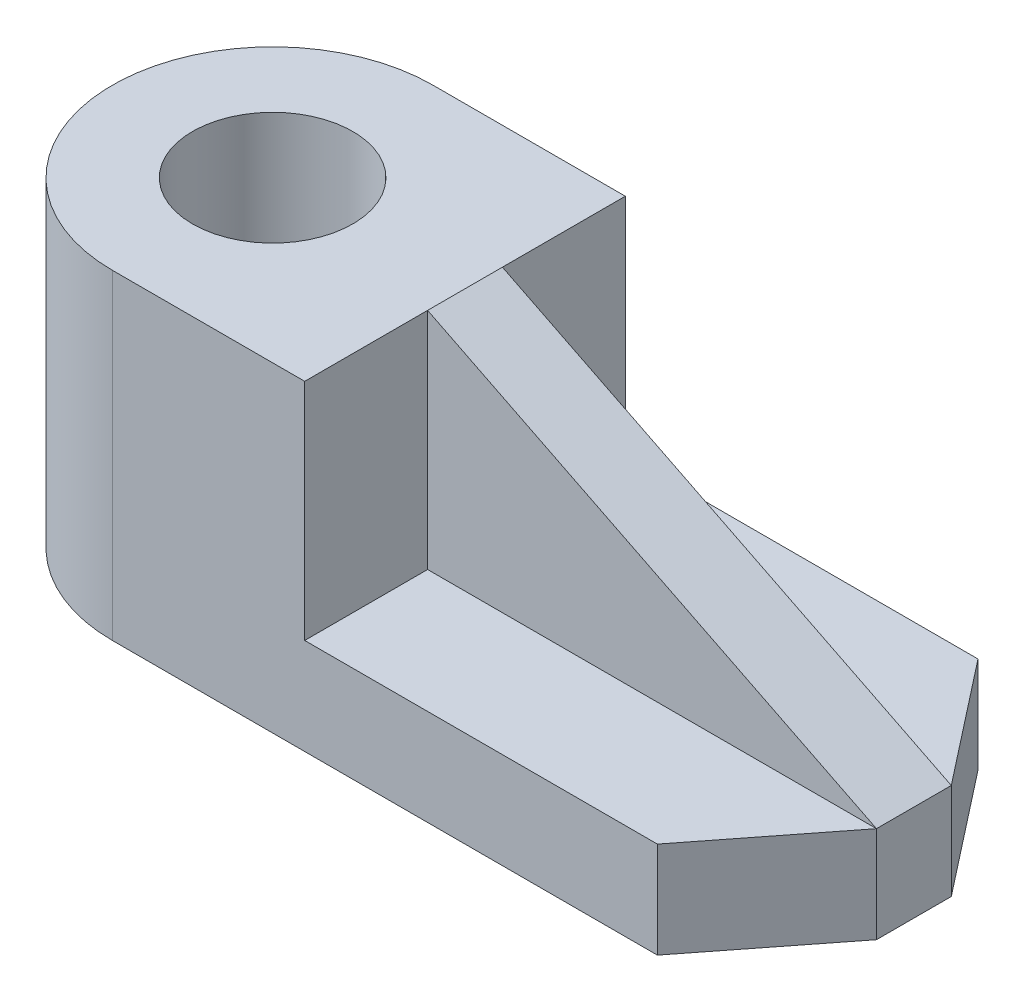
from build123d import *

# Parameters (mm, degrees)
CROQUIS5_R                   = 7.5
SALIENTE_EXTRUIR3_DEPTH      = 30
SALIENTE_EXTRUIR4_DEPTH      = 9
SALIENTE_EXTRUIR5_DEPTH      = 3.5
SALIENTE_EXTRUIR5_DEPTH_BACK = 3.5


with BuildPart() as part:
    # Croquis5 → Saliente-Extruir3 (new body)
    with BuildSketch(Plane(origin=(0, 0, 0), x_dir=(1, 0, 0), z_dir=(0, 1, 0))):
        with BuildLine():
            Line((0, 15), (18, 15))
            Line((18, 15), (18, -15))
            Line((18, -15), (0, -15))
            ThreePointArc((0, -15), (-15, 0), (0, 15))
        make_face()
        with Locations(Location((0, 0, 0), (0, 0, 270))):
            Circle(CROQUIS5_R, mode=Mode.SUBTRACT)
    extrude(amount=SALIENTE_EXTRUIR3_DEPTH)

    # Croquis6 → Saliente-Extruir4 (add)
    with BuildSketch(Plane(origin=(0, 0, 0), x_dir=(1, 0, 0), z_dir=(0, 1, 0))):
        Polygon((18, 15), (18, -15), (51, -15), (60, -3.5), (60, 3.5), (51, 15), align=None)
    extrude(amount=SALIENTE_EXTRUIR4_DEPTH)

    # Croquis8 → Saliente-Extruir5 (add, two sides: drawn at the far end of the back side and taken through both)
    with BuildSketch(Plane.XY.offset(-SALIENTE_EXTRUIR5_DEPTH_BACK)):
        Polygon((18, 30), (60, 9), (18, 9), align=None)
    extrude(amount=SALIENTE_EXTRUIR5_DEPTH + SALIENTE_EXTRUIR5_DEPTH_BACK)


solid = part.part
